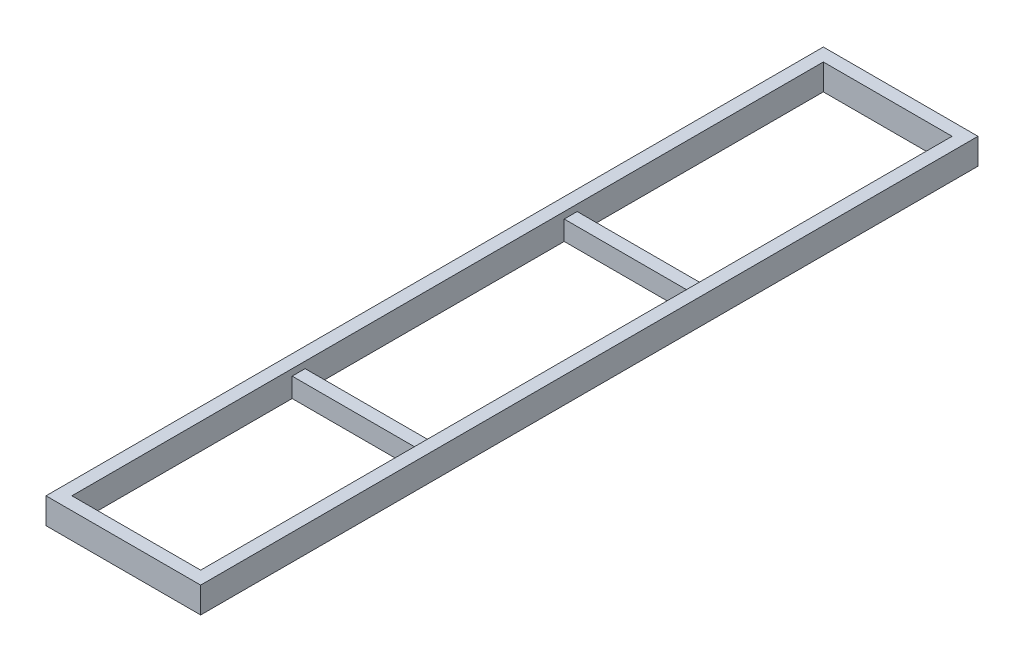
from build123d import *

# Parameters (mm, degrees)
SKETCH1_W           = 50.8
SKETCH1_H           = 101.6
SKETCH1_W_2         = 44.45
SKETCH1_H_2         = 95.25
BOSS_EXTRUDE1_DEPTH = 1524
SKETCH2_W           = 50.8
SKETCH2_H           = 101.6
SKETCH2_W_2         = 44.45
SKETCH2_H_2         = 95.25
BOSS_EXTRUDE2_DEPTH = 303.2125
SKETCH3_W           = 50.8
SKETCH3_H           = 76.2
SKETCH3_W_2         = 44.45
SKETCH3_H_2         = 69.85
BOSS_EXTRUDE3_DEPTH = 252.4125


with BuildPart() as part:
    # Sketch1 → Boss-Extrude1 (new, symmetric)
    with BuildSketch(Plane.XY):
        Rectangle(SKETCH1_W, SKETCH1_H)
        Rectangle(SKETCH1_W_2, SKETCH1_H_2, mode=Mode.SUBTRACT)
    extrude(amount=BOSS_EXTRUDE1_DEPTH, both=True)


with BuildPart() as body_2:
    # Mirror2: mirrored copy
    add(part.part.mirror(Plane(origin=(-277.8125, 0, 0), x_dir=(0, 0, 1), z_dir=(1, 0, 0))))


with BuildPart() as part_1:
    add(part.part)

    add(body_2.part)  # Boss-Extrude2 merges body 2
    # Sketch2 → Boss-Extrude2 (add, symmetric)
    # profile 1 of 2: a face of its own
    with BuildSketch(Plane(origin=(-277.8125, 0, 0), x_dir=(0, 0, -1), z_dir=(1, 0, 0))):
        with Locations((-1498.6, 0)):
            Rectangle(SKETCH2_W, SKETCH2_H)
        with Locations((-1498.6, 0)):
            Rectangle(SKETCH2_W_2, SKETCH2_H_2, mode=Mode.SUBTRACT)
    # profile 2 of 2: a face of its own
    with BuildSketch(Plane(origin=(-277.8125, 0, 0), x_dir=(0, 0, -1), z_dir=(1, 0, 0))):
        with Locations((1498.6, 0)):
            Rectangle(SKETCH2_W, SKETCH2_H)
        with Locations((1498.6, 0)):
            Rectangle(SKETCH2_W_2, SKETCH2_H_2, mode=Mode.SUBTRACT)
    extrude(amount=BOSS_EXTRUDE2_DEPTH, both=True)

    # Sketch3 → Boss-Extrude3 (add, symmetric)
    # profile 1 of 2: a face of its own
    with BuildSketch(Plane(origin=(-277.8125, 0, 0), x_dir=(0, 0, -1), z_dir=(1, 0, 0))):
        with Locations((-584.2, -12.7)):
            Rectangle(SKETCH3_W, SKETCH3_H)
        with Locations((-584.2, -12.7)):
            Rectangle(SKETCH3_W_2, SKETCH3_H_2, mode=Mode.SUBTRACT)
    # profile 2 of 2: a face of its own
    with BuildSketch(Plane(origin=(-277.8125, 0, 0), x_dir=(0, 0, -1), z_dir=(1, 0, 0))):
        with Locations((482.6, -12.7)):
            Rectangle(SKETCH3_W, SKETCH3_H)
        with Locations((482.6, -12.7)):
            Rectangle(SKETCH3_W_2, SKETCH3_H_2, mode=Mode.SUBTRACT)
    extrude(amount=BOSS_EXTRUDE3_DEPTH, both=True)


solid = part_1.part
